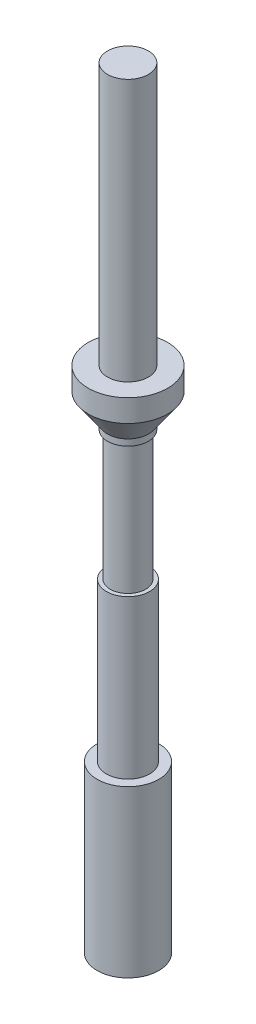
from build123d import *


with BuildPart() as part:
    # Sketch1 → Revolve1 (revolve)
    with BuildSketch(Plane.XY, mode=Mode.PRIVATE) as revolve1_sk:
        Polygon((0, 0), (2.65, 0), (2.65, -34), (5.15, -34), (5.15, -36.9), (2.65, -40.4), (2.65, -41.210283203), (2.3, -41.210283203), (2.3, -58.010283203), (2.8, -58.010283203), (2.8, -78.510283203), (4, -78.510283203), (4, -100), (0, -100), align=None)
    revolve(revolve1_sk.sketch.rotate(Axis((0, 0, 0), (0, -1, 0)), 180), axis=Axis((0, 0, 0), (0, -1, 0)))


solid = part.part
